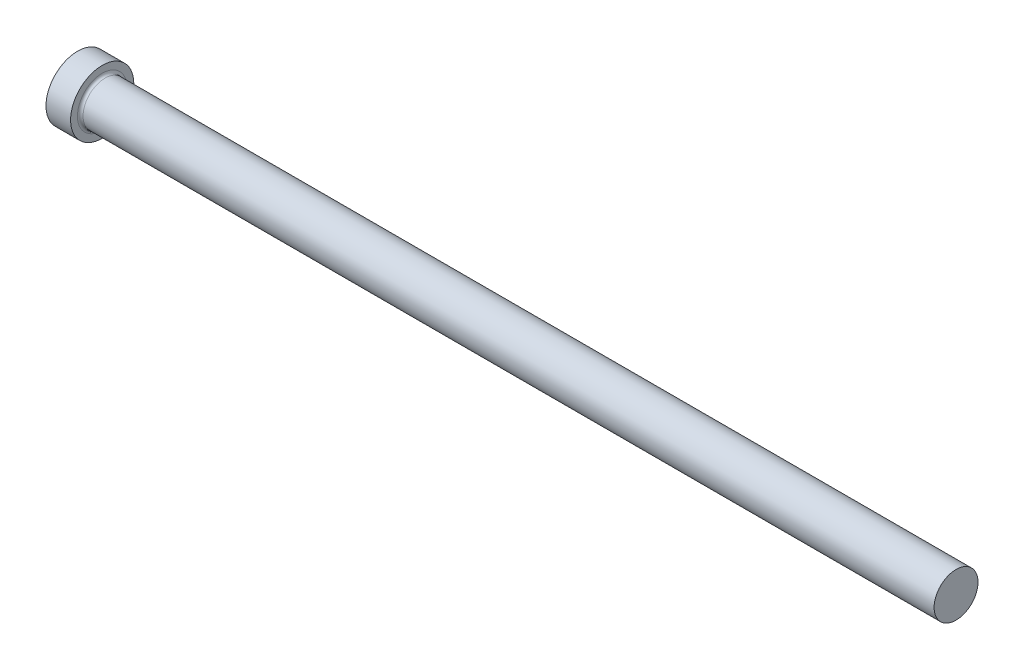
ISO-10303-21;
HEADER;
FILE_DESCRIPTION(('STEP AP214'),'2;1');
FILE_NAME('part.step','',(''),(''),'','','');
FILE_SCHEMA(('AUTOMOTIVE_DESIGN { 1 0 10303 214 1 1 1 1 }'));
ENDSEC;
DATA;
#1=APPLICATION_CONTEXT('core data for automotive mechanical design processes');
#2=APPLICATION_PROTOCOL_DEFINITION('international standard','automotive_design',2000,#1);
#3=PRODUCT_CONTEXT('',#1,'mechanical');
#4=PRODUCT('Part','Part','',(#3));
#5=PRODUCT_RELATED_PRODUCT_CATEGORY('part','',(#4));
#6=PRODUCT_DEFINITION_FORMATION('','',#4);
#7=PRODUCT_DEFINITION_CONTEXT('part definition',#1,'design');
#8=PRODUCT_DEFINITION('design','',#6,#7);
#9=PRODUCT_DEFINITION_SHAPE('','',#8);
#10=(LENGTH_UNIT() NAMED_UNIT(*) SI_UNIT(.MILLI.,.METRE.));
#11=(NAMED_UNIT(*) PLANE_ANGLE_UNIT() SI_UNIT($,.RADIAN.));
#12=(NAMED_UNIT(*) SI_UNIT($,.STERADIAN.) SOLID_ANGLE_UNIT());
#13=UNCERTAINTY_MEASURE_WITH_UNIT(LENGTH_MEASURE(1.E-05),#10,'distance_accuracy_value','');
#14=(GEOMETRIC_REPRESENTATION_CONTEXT(3) GLOBAL_UNCERTAINTY_ASSIGNED_CONTEXT((#13)) GLOBAL_UNIT_ASSIGNED_CONTEXT((#10,
#11,#12)) REPRESENTATION_CONTEXT('',''));
#15=CARTESIAN_POINT('',(0.,0.,0.));
#16=DIRECTION('',(0.,0.,1.));
#17=DIRECTION('',(1.,0.,0.));
#18=AXIS2_PLACEMENT_3D('',#15,#16,#17);
#19=CARTESIAN_POINT('',(0.,0.,0.));
#20=DIRECTION('',(-1.,0.,0.));
#21=DIRECTION('',(0.,-1.,0.));
#22=AXIS2_PLACEMENT_3D('',#19,#20,#21);
#23=PLANE('',#22);
#24=CARTESIAN_POINT('',(0.,0.,0.));
#25=DIRECTION('',(1.,0.,0.));
#26=DIRECTION('',(0.,1.,0.));
#27=AXIS2_PLACEMENT_3D('',#24,#25,#26);
#28=CIRCLE('',#27,9.);
#29=CARTESIAN_POINT('',(0.,9.,0.));
#30=VERTEX_POINT('',#29);
#31=EDGE_CURVE('E25',#30,#30,#28,.T.);
#32=ORIENTED_EDGE('',*,*,#31,.F.);
#33=EDGE_LOOP('',(#32));
#34=FACE_BOUND('',#33,.T.);
#35=ADVANCED_FACE('F14',(#34),#23,.T.);
#36=CARTESIAN_POINT('',(250.,0.,0.));
#37=DIRECTION('',(1.,0.,0.));
#38=DIRECTION('',(0.,1.,0.));
#39=AXIS2_PLACEMENT_3D('',#36,#37,#38);
#40=CYLINDRICAL_SURFACE('',#39,9.);
#41=ORIENTED_EDGE('',*,*,#31,.T.);
#42=EDGE_LOOP('',(#41));
#43=FACE_BOUND('',#42,.T.);
#44=CARTESIAN_POINT('',(7.,0.,0.));
#45=DIRECTION('',(1.,0.,0.));
#46=DIRECTION('',(0.,1.,0.));
#47=AXIS2_PLACEMENT_3D('',#44,#45,#46);
#48=CIRCLE('',#47,9.);
#49=CARTESIAN_POINT('',(7.,9.,0.));
#50=VERTEX_POINT('',#49);
#51=EDGE_CURVE('E29',#50,#50,#48,.T.);
#52=ORIENTED_EDGE('',*,*,#51,.F.);
#53=EDGE_LOOP('',(#52));
#54=FACE_BOUND('',#53,.T.);
#55=ADVANCED_FACE('F51',(#43,#54),#40,.T.);
#56=CARTESIAN_POINT('',(7.,9.,0.));
#57=DIRECTION('',(1.,0.,0.));
#58=DIRECTION('',(0.,1.,0.));
#59=AXIS2_PLACEMENT_3D('',#56,#57,#58);
#60=PLANE('',#59);
#61=CARTESIAN_POINT('',(7.,0.,0.));
#62=DIRECTION('',(1.,0.,0.));
#63=DIRECTION('',(0.,1.,0.));
#64=AXIS2_PLACEMENT_3D('',#61,#62,#63);
#65=CIRCLE('',#64,7.05);
#66=CARTESIAN_POINT('',(7.,7.05,0.));
#67=VERTEX_POINT('',#66);
#68=EDGE_CURVE('E9',#67,#67,#65,.F.);
#69=ORIENTED_EDGE('',*,*,#68,.T.);
#70=EDGE_LOOP('',(#69));
#71=FACE_BOUND('',#70,.T.);
#72=ORIENTED_EDGE('',*,*,#51,.T.);
#73=EDGE_LOOP('',(#72));
#74=FACE_BOUND('',#73,.T.);
#75=ADVANCED_FACE('F42',(#71,#74),#60,.T.);
#76=CARTESIAN_POINT('',(250.,0.,0.));
#77=DIRECTION('',(1.,0.,0.));
#78=DIRECTION('',(0.,1.,0.));
#79=AXIS2_PLACEMENT_3D('',#76,#77,#78);
#80=CYLINDRICAL_SURFACE('',#79,6.25);
#81=CARTESIAN_POINT('',(7.8,0.,0.));
#82=DIRECTION('',(1.,0.,0.));
#83=DIRECTION('',(0.,1.,0.));
#84=AXIS2_PLACEMENT_3D('',#81,#82,#83);
#85=CIRCLE('',#84,6.25);
#86=CARTESIAN_POINT('',(7.8,6.25,0.));
#87=VERTEX_POINT('',#86);
#88=EDGE_CURVE('E21',#87,#87,#85,.T.);
#89=ORIENTED_EDGE('',*,*,#88,.T.);
#90=EDGE_LOOP('',(#89));
#91=FACE_BOUND('',#90,.T.);
#92=CARTESIAN_POINT('',(250.,0.,0.));
#93=DIRECTION('',(1.,0.,0.));
#94=DIRECTION('',(0.,1.,0.));
#95=AXIS2_PLACEMENT_3D('',#92,#93,#94);
#96=CIRCLE('',#95,6.25);
#97=CARTESIAN_POINT('',(250.,6.25000000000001,0.));
#98=VERTEX_POINT('',#97);
#99=EDGE_CURVE('E34',#98,#98,#96,.T.);
#100=ORIENTED_EDGE('',*,*,#99,.F.);
#101=EDGE_LOOP('',(#100));
#102=FACE_BOUND('',#101,.T.);
#103=ADVANCED_FACE('F40',(#91,#102),#80,.T.);
#104=CARTESIAN_POINT('',(250.,6.25,0.));
#105=DIRECTION('',(1.,0.,0.));
#106=DIRECTION('',(0.,1.,0.));
#107=AXIS2_PLACEMENT_3D('',#104,#105,#106);
#108=PLANE('',#107);
#109=ORIENTED_EDGE('',*,*,#99,.T.);
#110=EDGE_LOOP('',(#109));
#111=FACE_BOUND('',#110,.T.);
#112=ADVANCED_FACE('F38',(#111),#108,.T.);
#113=CARTESIAN_POINT('',(7.8,0.,0.));
#114=DIRECTION('',(1.,0.,0.));
#115=DIRECTION('',(0.,1.,0.));
#116=AXIS2_PLACEMENT_3D('',#113,#114,#115);
#117=TOROIDAL_SURFACE('',#116,7.05,0.8);
#118=ORIENTED_EDGE('',*,*,#68,.F.);
#119=EDGE_LOOP('',(#118));
#120=FACE_BOUND('',#119,.T.);
#121=ORIENTED_EDGE('',*,*,#88,.F.);
#122=EDGE_LOOP('',(#121));
#123=FACE_BOUND('',#122,.T.);
#124=ADVANCED_FACE('F16',(#120,#123),#117,.F.);
#125=CLOSED_SHELL('',(#35,#55,#75,#103,#112,#124));
#126=MANIFOLD_SOLID_BREP('B1',#125);
#127=ADVANCED_BREP_SHAPE_REPRESENTATION('',(#18,#126),#14);
#128=SHAPE_DEFINITION_REPRESENTATION(#9,#127);
ENDSEC;
END-ISO-10303-21;
